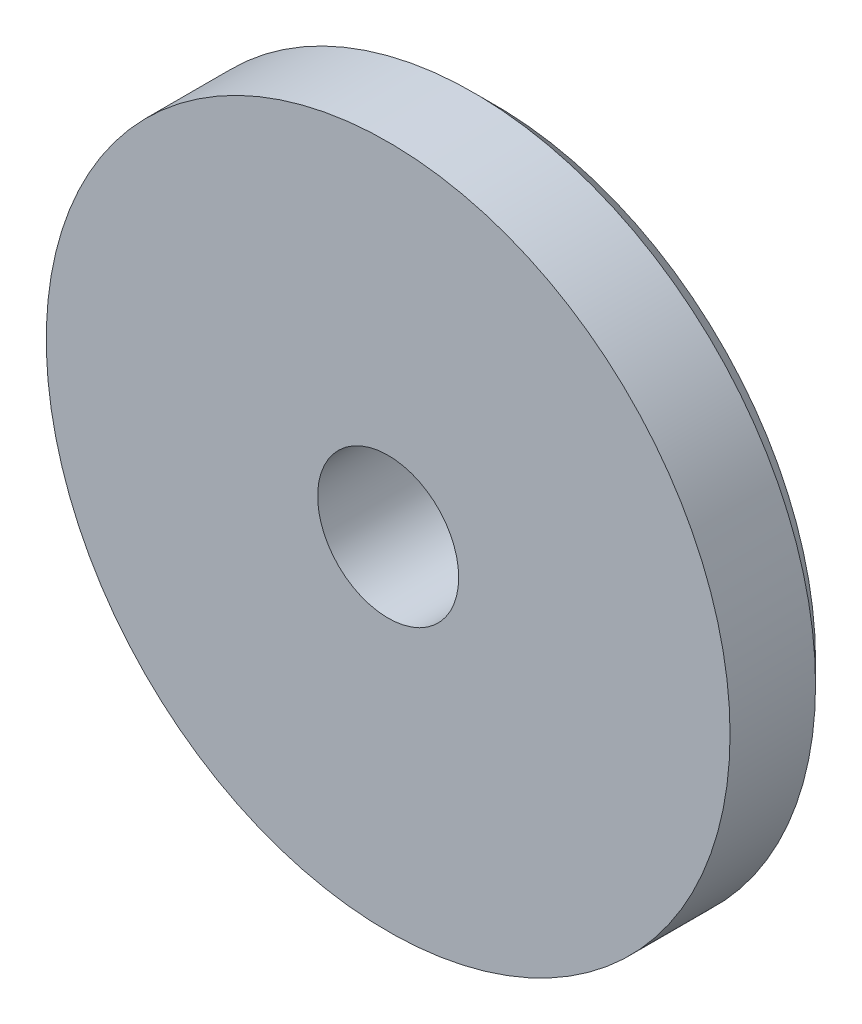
ISO-10303-21;
HEADER;
FILE_DESCRIPTION(('STEP AP214'),'2;1');
FILE_NAME('part.step','',(''),(''),'','','');
FILE_SCHEMA(('AUTOMOTIVE_DESIGN { 1 0 10303 214 1 1 1 1 }'));
ENDSEC;
DATA;
#1=APPLICATION_CONTEXT('core data for automotive mechanical design processes');
#2=APPLICATION_PROTOCOL_DEFINITION('international standard','automotive_design',2000,#1);
#3=PRODUCT_CONTEXT('',#1,'mechanical');
#4=PRODUCT('Part','Part','',(#3));
#5=PRODUCT_RELATED_PRODUCT_CATEGORY('part','',(#4));
#6=PRODUCT_DEFINITION_FORMATION('','',#4);
#7=PRODUCT_DEFINITION_CONTEXT('part definition',#1,'design');
#8=PRODUCT_DEFINITION('design','',#6,#7);
#9=PRODUCT_DEFINITION_SHAPE('','',#8);
#10=(LENGTH_UNIT() NAMED_UNIT(*) SI_UNIT(.MILLI.,.METRE.));
#11=(NAMED_UNIT(*) PLANE_ANGLE_UNIT() SI_UNIT($,.RADIAN.));
#12=(NAMED_UNIT(*) SI_UNIT($,.STERADIAN.) SOLID_ANGLE_UNIT());
#13=UNCERTAINTY_MEASURE_WITH_UNIT(LENGTH_MEASURE(1.E-05),#10,'distance_accuracy_value','');
#14=(GEOMETRIC_REPRESENTATION_CONTEXT(3) GLOBAL_UNCERTAINTY_ASSIGNED_CONTEXT((#13)) GLOBAL_UNIT_ASSIGNED_CONTEXT((#10,
#11,#12)) REPRESENTATION_CONTEXT('',''));
#15=CARTESIAN_POINT('',(0.,0.,0.));
#16=DIRECTION('',(0.,0.,1.));
#17=DIRECTION('',(1.,0.,0.));
#18=AXIS2_PLACEMENT_3D('',#15,#16,#17);
#19=CARTESIAN_POINT('',(0.,16.,0.));
#20=DIRECTION('',(0.,0.,-1.));
#21=DIRECTION('',(-1.,0.,0.));
#22=AXIS2_PLACEMENT_3D('',#19,#20,#21);
#23=PLANE('',#22);
#24=CARTESIAN_POINT('',(0.,0.,0.));
#25=DIRECTION('',(0.,0.,1.));
#26=DIRECTION('',(1.,0.,0.));
#27=AXIS2_PLACEMENT_3D('',#24,#25,#26);
#28=CIRCLE('',#27,3.3);
#29=CARTESIAN_POINT('',(3.3,0.,0.));
#30=VERTEX_POINT('',#29);
#31=EDGE_CURVE('E10',#30,#30,#28,.T.);
#32=ORIENTED_EDGE('',*,*,#31,.F.);
#33=EDGE_LOOP('',(#32));
#34=FACE_BOUND('',#33,.T.);
#35=CARTESIAN_POINT('',(0.,0.,0.));
#36=DIRECTION('',(0.,0.,1.));
#37=DIRECTION('',(1.,0.,0.));
#38=AXIS2_PLACEMENT_3D('',#35,#36,#37);
#39=CIRCLE('',#38,16.);
#40=CARTESIAN_POINT('',(16.,0.,0.));
#41=VERTEX_POINT('',#40);
#42=EDGE_CURVE('E52',#41,#41,#39,.T.);
#43=ORIENTED_EDGE('',*,*,#42,.T.);
#44=EDGE_LOOP('',(#43));
#45=FACE_BOUND('',#44,.T.);
#46=ADVANCED_FACE('F33',(#34,#45),#23,.F.);
#47=CARTESIAN_POINT('',(0.,0.,0.));
#48=DIRECTION('',(0.,0.,1.));
#49=DIRECTION('',(1.,0.,0.));
#50=AXIS2_PLACEMENT_3D('',#47,#48,#49);
#51=CYLINDRICAL_SURFACE('',#50,3.3);
#52=CARTESIAN_POINT('',(0.,0.,-5.));
#53=DIRECTION('',(0.,0.,1.));
#54=DIRECTION('',(1.,0.,0.));
#55=AXIS2_PLACEMENT_3D('',#52,#53,#54);
#56=CIRCLE('',#55,3.3);
#57=CARTESIAN_POINT('',(3.3,0.,-5.));
#58=VERTEX_POINT('',#57);
#59=EDGE_CURVE('E39',#58,#58,#56,.T.);
#60=ORIENTED_EDGE('',*,*,#59,.F.);
#61=EDGE_LOOP('',(#60));
#62=FACE_BOUND('',#61,.T.);
#63=ORIENTED_EDGE('',*,*,#31,.T.);
#64=EDGE_LOOP('',(#63));
#65=FACE_BOUND('',#64,.T.);
#66=ADVANCED_FACE('F88',(#62,#65),#51,.F.);
#67=CARTESIAN_POINT('',(0.,3.3,-5.));
#68=DIRECTION('',(0.,0.,1.));
#69=DIRECTION('',(1.,0.,0.));
#70=AXIS2_PLACEMENT_3D('',#67,#68,#69);
#71=PLANE('',#70);
#72=CARTESIAN_POINT('',(0.,0.,-5.));
#73=DIRECTION('',(0.,0.,1.));
#74=DIRECTION('',(1.,0.,0.));
#75=AXIS2_PLACEMENT_3D('',#72,#73,#74);
#76=CIRCLE('',#75,4.6);
#77=CARTESIAN_POINT('',(4.6,0.,-5.));
#78=VERTEX_POINT('',#77);
#79=EDGE_CURVE('E61',#78,#78,#76,.T.);
#80=ORIENTED_EDGE('',*,*,#79,.T.);
#81=EDGE_LOOP('',(#80));
#82=FACE_BOUND('',#81,.T.);
#83=CARTESIAN_POINT('',(0.,0.,-5.));
#84=DIRECTION('',(0.,0.,1.));
#85=DIRECTION('',(1.,0.,0.));
#86=AXIS2_PLACEMENT_3D('',#83,#84,#85);
#87=CIRCLE('',#86,15.);
#88=CARTESIAN_POINT('',(15.,0.,-5.));
#89=VERTEX_POINT('',#88);
#90=EDGE_CURVE('E43',#89,#89,#87,.T.);
#91=ORIENTED_EDGE('',*,*,#90,.F.);
#92=EDGE_LOOP('',(#91));
#93=FACE_BOUND('',#92,.T.);
#94=ADVANCED_FACE('F93',(#82,#93),#71,.F.);
#95=CARTESIAN_POINT('',(0.,0.,-5.));
#96=DIRECTION('',(0.,0.,1.));
#97=DIRECTION('',(1.,0.,0.));
#98=AXIS2_PLACEMENT_3D('',#95,#96,#97);
#99=CONICAL_SURFACE('',#98,15.,0.785398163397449);
#100=CARTESIAN_POINT('',(0.,0.,-4.));
#101=DIRECTION('',(0.,0.,1.));
#102=DIRECTION('',(1.,0.,0.));
#103=AXIS2_PLACEMENT_3D('',#100,#101,#102);
#104=CIRCLE('',#103,16.);
#105=CARTESIAN_POINT('',(16.,0.,-4.));
#106=VERTEX_POINT('',#105);
#107=EDGE_CURVE('E47',#106,#106,#104,.T.);
#108=ORIENTED_EDGE('',*,*,#107,.F.);
#109=EDGE_LOOP('',(#108));
#110=FACE_BOUND('',#109,.T.);
#111=ORIENTED_EDGE('',*,*,#90,.T.);
#112=EDGE_LOOP('',(#111));
#113=FACE_BOUND('',#112,.T.);
#114=ADVANCED_FACE('F100',(#110,#113),#99,.T.);
#115=CARTESIAN_POINT('',(0.,0.,0.));
#116=DIRECTION('',(0.,0.,1.));
#117=DIRECTION('',(1.,0.,0.));
#118=AXIS2_PLACEMENT_3D('',#115,#116,#117);
#119=CYLINDRICAL_SURFACE('',#118,16.);
#120=ORIENTED_EDGE('',*,*,#42,.F.);
#121=EDGE_LOOP('',(#120));
#122=FACE_BOUND('',#121,.T.);
#123=ORIENTED_EDGE('',*,*,#107,.T.);
#124=EDGE_LOOP('',(#123));
#125=FACE_BOUND('',#124,.T.);
#126=ADVANCED_FACE('F83',(#122,#125),#119,.T.);
#127=CARTESIAN_POINT('',(3.,0.,-5.));
#128=DIRECTION('',(0.,0.,1.));
#129=DIRECTION('',(1.,0.,0.));
#130=AXIS2_PLACEMENT_3D('',#127,#128,#129);
#131=PLANE('',#130);
#132=CARTESIAN_POINT('',(0.,0.,-5.));
#133=DIRECTION('',(0.,0.,1.));
#134=DIRECTION('',(1.,0.,0.));
#135=AXIS2_PLACEMENT_3D('',#132,#133,#134);
#136=CIRCLE('',#135,3.);
#137=CARTESIAN_POINT('',(3.,0.,-5.));
#138=VERTEX_POINT('',#137);
#139=EDGE_CURVE('E58',#138,#138,#136,.T.);
#140=ORIENTED_EDGE('',*,*,#139,.F.);
#141=EDGE_LOOP('',(#140));
#142=FACE_BOUND('',#141,.T.);
#143=ORIENTED_EDGE('',*,*,#59,.T.);
#144=EDGE_LOOP('',(#143));
#145=FACE_BOUND('',#144,.T.);
#146=ADVANCED_FACE('F74',(#142,#145),#131,.T.);
#147=CARTESIAN_POINT('',(4.6,0.,-6.6));
#148=DIRECTION('',(0.,0.,-1.));
#149=DIRECTION('',(-1.,0.,0.));
#150=AXIS2_PLACEMENT_3D('',#147,#148,#149);
#151=PLANE('',#150);
#152=CARTESIAN_POINT('',(0.,0.,-6.6));
#153=DIRECTION('',(0.,0.,1.));
#154=DIRECTION('',(1.,0.,0.));
#155=AXIS2_PLACEMENT_3D('',#152,#153,#154);
#156=CIRCLE('',#155,3.);
#157=CARTESIAN_POINT('',(3.,0.,-6.6));
#158=VERTEX_POINT('',#157);
#159=EDGE_CURVE('E55',#158,#158,#156,.T.);
#160=ORIENTED_EDGE('',*,*,#159,.T.);
#161=EDGE_LOOP('',(#160));
#162=FACE_BOUND('',#161,.T.);
#163=CARTESIAN_POINT('',(0.,0.,-6.6));
#164=DIRECTION('',(0.,0.,1.));
#165=DIRECTION('',(1.,0.,0.));
#166=AXIS2_PLACEMENT_3D('',#163,#164,#165);
#167=CIRCLE('',#166,4.6);
#168=CARTESIAN_POINT('',(4.6,0.,-6.6));
#169=VERTEX_POINT('',#168);
#170=EDGE_CURVE('E64',#169,#169,#167,.T.);
#171=ORIENTED_EDGE('',*,*,#170,.F.);
#172=EDGE_LOOP('',(#171));
#173=FACE_BOUND('',#172,.T.);
#174=ADVANCED_FACE('F71',(#162,#173),#151,.T.);
#175=CARTESIAN_POINT('',(0.,0.,0.));
#176=DIRECTION('',(0.,0.,1.));
#177=DIRECTION('',(1.,0.,0.));
#178=AXIS2_PLACEMENT_3D('',#175,#176,#177);
#179=CYLINDRICAL_SURFACE('',#178,3.);
#180=ORIENTED_EDGE('',*,*,#139,.T.);
#181=EDGE_LOOP('',(#180));
#182=FACE_BOUND('',#181,.T.);
#183=ORIENTED_EDGE('',*,*,#159,.F.);
#184=EDGE_LOOP('',(#183));
#185=FACE_BOUND('',#184,.T.);
#186=ADVANCED_FACE('F73',(#182,#185),#179,.F.);
#187=CARTESIAN_POINT('',(0.,0.,0.));
#188=DIRECTION('',(0.,0.,1.));
#189=DIRECTION('',(1.,0.,0.));
#190=AXIS2_PLACEMENT_3D('',#187,#188,#189);
#191=CYLINDRICAL_SURFACE('',#190,4.6);
#192=ORIENTED_EDGE('',*,*,#170,.T.);
#193=EDGE_LOOP('',(#192));
#194=FACE_BOUND('',#193,.T.);
#195=ORIENTED_EDGE('',*,*,#79,.F.);
#196=EDGE_LOOP('',(#195));
#197=FACE_BOUND('',#196,.T.);
#198=ADVANCED_FACE('F68',(#194,#197),#191,.T.);
#199=CLOSED_SHELL('',(#46,#66,#94,#114,#126,#146,#174,#186,#198));
#200=MANIFOLD_SOLID_BREP('B2',#199);
#201=ADVANCED_BREP_SHAPE_REPRESENTATION('',(#18,#200),#14);
#202=SHAPE_DEFINITION_REPRESENTATION(#9,#201);
ENDSEC;
END-ISO-10303-21;
